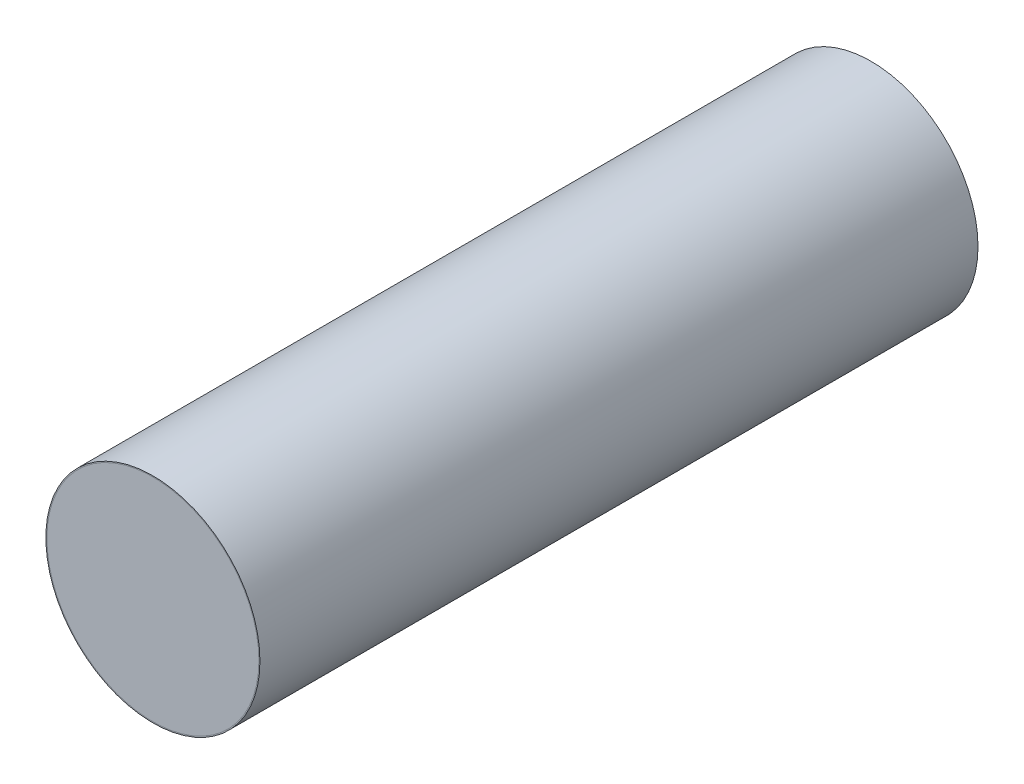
from build123d import *

# Parameters (mm, degrees)
SKETCH1_R            = 10.35
BOSS_EXTRUDE1_DEPTH  = 0.3
BOSS_EXTRUDE2_START  = 0.3
SKETCH2_R            = 10.35
SKETCH2_R_2          = 10.13
BOSS_EXTRUDE2_DEPTH  = 69
BOSS_EXTRUDE4_START  = 69.3
SKETCH3_R            = 10.35
BOSS_EXTRUDE4_DEPTH  = 0.8
SKETCH4_R            = 10.45
SKETCH4_R_2          = 10.35
BOSS_EXTRUDE5_DEPTH  = 70.1
BOSS_EXTRUDE7_START  = 0.3
SKETCH5_R            = 10.13
BOSS_EXTRUDE7_DEPTH  = 2.2
BOSS_EXTRUDE8_START  = 67.5
SKETCH6_R            = 10.13
BOSS_EXTRUDE8_DEPTH  = 1.8
BOSS_EXTRUDE9_START  = 2.5
SKETCH7_R            = 10.03
SKETCH7_R_2          = 1.5
BOSS_EXTRUDE9_DEPTH  = 65
BOSS_EXTRUDE10_START = 2.5
SKETCH8_R            = 10.13
SKETCH8_R_2          = 10.03
BOSS_EXTRUDE10_DEPTH = 65


with BuildPart() as part:
    # Sketch1 → Boss-Extrude1 (new body)
    with BuildSketch(Plane.XY):
        Circle(SKETCH1_R)
    extrude(amount=BOSS_EXTRUDE1_DEPTH)

    # Sketch2 → Boss-Extrude2 (add)
    with BuildSketch(Plane.XY.offset(BOSS_EXTRUDE2_START)):
        Circle(SKETCH2_R)
        Circle(SKETCH2_R_2, mode=Mode.SUBTRACT)
    extrude(amount=BOSS_EXTRUDE2_DEPTH)


with BuildPart() as body_2:
    # Sketch3 → Boss-Extrude4 (new body)
    with BuildSketch(Plane.XY.offset(BOSS_EXTRUDE4_START)):
        Circle(SKETCH3_R)
    extrude(amount=BOSS_EXTRUDE4_DEPTH)


with BuildPart() as body_3:
    # Sketch4 → Boss-Extrude5 (new body)
    with BuildSketch(Plane.XY):
        Circle(SKETCH4_R)
        Circle(SKETCH4_R_2, mode=Mode.SUBTRACT)
    extrude(amount=BOSS_EXTRUDE5_DEPTH)


with BuildPart() as body_4:
    # Sketch5 → Boss-Extrude7 (new body)
    with BuildSketch(Plane.XY.offset(BOSS_EXTRUDE7_START)):
        Circle(SKETCH5_R)
    extrude(amount=BOSS_EXTRUDE7_DEPTH)


with BuildPart() as body_5:
    # Sketch6 → Boss-Extrude8 (new body)
    with BuildSketch(Plane.XY.offset(BOSS_EXTRUDE8_START)):
        Circle(SKETCH6_R)
    extrude(amount=BOSS_EXTRUDE8_DEPTH)


with BuildPart() as body_6:
    # Sketch7 → Boss-Extrude9 (new body)
    with BuildSketch(Plane.XY.offset(BOSS_EXTRUDE9_START)):
        Circle(SKETCH7_R)
        Circle(SKETCH7_R_2, mode=Mode.SUBTRACT)
    extrude(amount=BOSS_EXTRUDE9_DEPTH)


with BuildPart() as body_7:
    # Sketch8 → Boss-Extrude10 (new body)
    with BuildSketch(Plane.XY.offset(BOSS_EXTRUDE10_START)):
        Circle(SKETCH8_R)
        Circle(SKETCH8_R_2, mode=Mode.SUBTRACT)
    extrude(amount=BOSS_EXTRUDE10_DEPTH)


solid = Compound([part.part, body_2.part, body_3.part, body_4.part, body_5.part, body_6.part, body_7.part])
